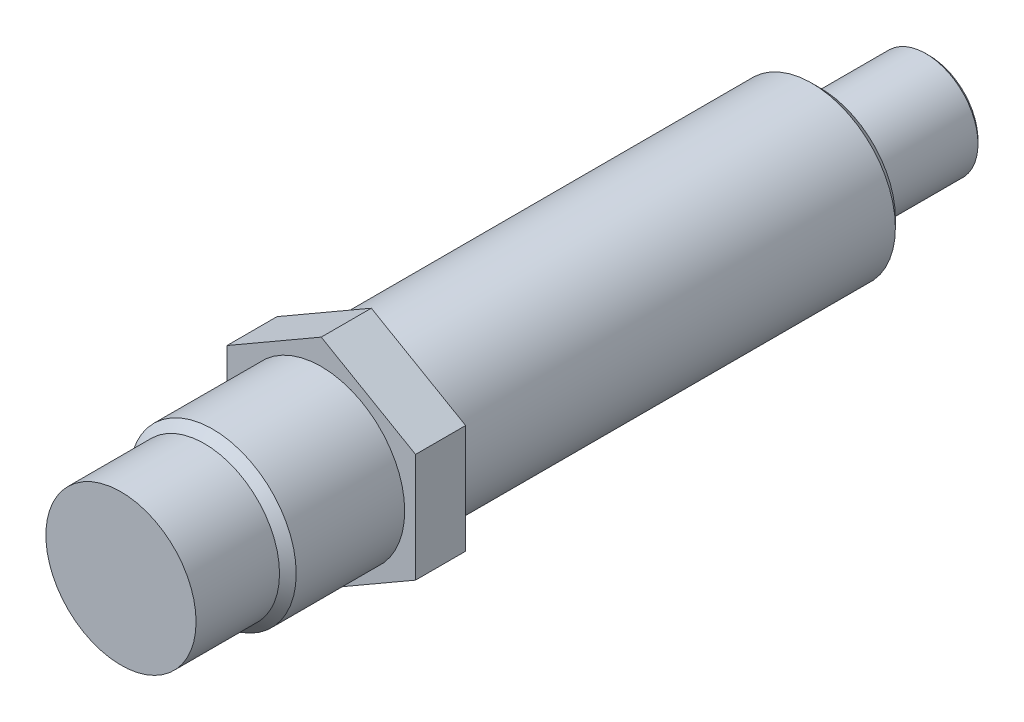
ISO-10303-21;
HEADER;
FILE_DESCRIPTION(('STEP AP214'),'2;1');
FILE_NAME('part.step','',(''),(''),'','','');
FILE_SCHEMA(('AUTOMOTIVE_DESIGN { 1 0 10303 214 1 1 1 1 }'));
ENDSEC;
DATA;
#1=APPLICATION_CONTEXT('core data for automotive mechanical design processes');
#2=APPLICATION_PROTOCOL_DEFINITION('international standard','automotive_design',2000,#1);
#3=PRODUCT_CONTEXT('',#1,'mechanical');
#4=PRODUCT('Part','Part','',(#3));
#5=PRODUCT_RELATED_PRODUCT_CATEGORY('part','',(#4));
#6=PRODUCT_DEFINITION_FORMATION('','',#4);
#7=PRODUCT_DEFINITION_CONTEXT('part definition',#1,'design');
#8=PRODUCT_DEFINITION('design','',#6,#7);
#9=PRODUCT_DEFINITION_SHAPE('','',#8);
#10=(LENGTH_UNIT() NAMED_UNIT(*) SI_UNIT(.MILLI.,.METRE.));
#11=(NAMED_UNIT(*) PLANE_ANGLE_UNIT() SI_UNIT($,.RADIAN.));
#12=(NAMED_UNIT(*) SI_UNIT($,.STERADIAN.) SOLID_ANGLE_UNIT());
#13=UNCERTAINTY_MEASURE_WITH_UNIT(LENGTH_MEASURE(1.E-05),#10,'distance_accuracy_value','');
#14=(GEOMETRIC_REPRESENTATION_CONTEXT(3) GLOBAL_UNCERTAINTY_ASSIGNED_CONTEXT((#13)) GLOBAL_UNIT_ASSIGNED_CONTEXT((#10,
#11,#12)) REPRESENTATION_CONTEXT('',''));
#15=CARTESIAN_POINT('',(0.,0.,0.));
#16=DIRECTION('',(0.,0.,1.));
#17=DIRECTION('',(1.,0.,0.));
#18=AXIS2_PLACEMENT_3D('',#15,#16,#17);
#19=CARTESIAN_POINT('',(0.,0.,-122.9995));
#20=DIRECTION('',(0.,0.,1.));
#21=DIRECTION('',(1.,0.,0.));
#22=AXIS2_PLACEMENT_3D('',#19,#20,#21);
#23=PLANE('',#22);
#24=CARTESIAN_POINT('',(0.,0.,-122.9995));
#25=DIRECTION('',(0.,0.,1.));
#26=DIRECTION('',(1.,0.,0.));
#27=AXIS2_PLACEMENT_3D('',#24,#25,#26);
#28=CIRCLE('',#27,7.4295);
#29=CARTESIAN_POINT('',(7.4295,0.,-122.9995));
#30=VERTEX_POINT('',#29);
#31=EDGE_CURVE('E48',#30,#30,#28,.T.);
#32=ORIENTED_EDGE('',*,*,#31,.F.);
#33=EDGE_LOOP('',(#32));
#34=FACE_BOUND('',#33,.T.);
#35=ADVANCED_FACE('F40',(#34),#23,.F.);
#36=CARTESIAN_POINT('',(0.,0.,-122.9995));
#37=DIRECTION('',(0.,0.,1.));
#38=DIRECTION('',(1.,0.,0.));
#39=AXIS2_PLACEMENT_3D('',#36,#37,#38);
#40=CONICAL_SURFACE('',#39,7.4295,0.785398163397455);
#41=CARTESIAN_POINT('',(0.,0.,-122.4915));
#42=DIRECTION('',(0.,0.,1.));
#43=DIRECTION('',(1.,0.,0.));
#44=AXIS2_PLACEMENT_3D('',#41,#42,#43);
#45=CIRCLE('',#44,7.9375);
#46=CARTESIAN_POINT('',(7.9375,0.,-122.4915));
#47=VERTEX_POINT('',#46);
#48=EDGE_CURVE('E170',#47,#47,#45,.T.);
#49=ORIENTED_EDGE('',*,*,#48,.F.);
#50=EDGE_LOOP('',(#49));
#51=FACE_BOUND('',#50,.T.);
#52=ORIENTED_EDGE('',*,*,#31,.T.);
#53=EDGE_LOOP('',(#52));
#54=FACE_BOUND('',#53,.T.);
#55=ADVANCED_FACE('F196',(#51,#54),#40,.T.);
#56=CARTESIAN_POINT('',(0.,0.,0.));
#57=DIRECTION('',(0.,0.,1.));
#58=DIRECTION('',(1.,0.,0.));
#59=AXIS2_PLACEMENT_3D('',#56,#57,#58);
#60=CYLINDRICAL_SURFACE('',#59,7.9375);
#61=CARTESIAN_POINT('',(0.,0.,-108.712));
#62=DIRECTION('',(0.,0.,1.));
#63=DIRECTION('',(1.,0.,0.));
#64=AXIS2_PLACEMENT_3D('',#61,#62,#63);
#65=CIRCLE('',#64,7.93749999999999);
#66=CARTESIAN_POINT('',(7.93749999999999,0.,-108.712));
#67=VERTEX_POINT('',#66);
#68=EDGE_CURVE('E167',#67,#67,#65,.T.);
#69=ORIENTED_EDGE('',*,*,#68,.F.);
#70=EDGE_LOOP('',(#69));
#71=FACE_BOUND('',#70,.T.);
#72=ORIENTED_EDGE('',*,*,#48,.T.);
#73=EDGE_LOOP('',(#72));
#74=FACE_BOUND('',#73,.T.);
#75=ADVANCED_FACE('F201',(#71,#74),#60,.T.);
#76=CARTESIAN_POINT('',(0.,7.93749999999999,-108.712));
#77=DIRECTION('',(0.,0.,-1.));
#78=DIRECTION('',(-1.,0.,0.));
#79=AXIS2_PLACEMENT_3D('',#76,#77,#78);
#80=PLANE('',#79);
#81=CARTESIAN_POINT('',(0.,0.,-108.712));
#82=DIRECTION('',(0.,0.,1.));
#83=DIRECTION('',(1.,0.,0.));
#84=AXIS2_PLACEMENT_3D('',#81,#82,#83);
#85=CIRCLE('',#84,3.175);
#86=CARTESIAN_POINT('',(3.175,0.,-108.712));
#87=VERTEX_POINT('',#86);
#88=EDGE_CURVE('E164',#87,#87,#85,.T.);
#89=ORIENTED_EDGE('',*,*,#88,.F.);
#90=EDGE_LOOP('',(#89));
#91=FACE_BOUND('',#90,.T.);
#92=ORIENTED_EDGE('',*,*,#68,.T.);
#93=EDGE_LOOP('',(#92));
#94=FACE_BOUND('',#93,.T.);
#95=ADVANCED_FACE('F208',(#91,#94),#80,.F.);
#96=CARTESIAN_POINT('',(0.,0.,0.));
#97=DIRECTION('',(0.,0.,1.));
#98=DIRECTION('',(1.,0.,0.));
#99=AXIS2_PLACEMENT_3D('',#96,#97,#98);
#100=CYLINDRICAL_SURFACE('',#99,3.175);
#101=CARTESIAN_POINT('',(0.,0.,-106.426));
#102=DIRECTION('',(0.,0.,1.));
#103=DIRECTION('',(1.,0.,0.));
#104=AXIS2_PLACEMENT_3D('',#101,#102,#103);
#105=CIRCLE('',#104,3.175);
#106=CARTESIAN_POINT('',(3.175,0.,-106.426));
#107=VERTEX_POINT('',#106);
#108=EDGE_CURVE('E161',#107,#107,#105,.T.);
#109=ORIENTED_EDGE('',*,*,#108,.F.);
#110=EDGE_LOOP('',(#109));
#111=FACE_BOUND('',#110,.T.);
#112=ORIENTED_EDGE('',*,*,#88,.T.);
#113=EDGE_LOOP('',(#112));
#114=FACE_BOUND('',#113,.T.);
#115=ADVANCED_FACE('F215',(#111,#114),#100,.T.);
#116=CARTESIAN_POINT('',(0.,3.175,-106.426));
#117=DIRECTION('',(0.,0.,1.));
#118=DIRECTION('',(1.,0.,0.));
#119=AXIS2_PLACEMENT_3D('',#116,#117,#118);
#120=PLANE('',#119);
#121=CARTESIAN_POINT('',(0.,0.,-106.426));
#122=DIRECTION('',(0.,0.,1.));
#123=DIRECTION('',(1.,0.,0.));
#124=AXIS2_PLACEMENT_3D('',#121,#122,#123);
#125=CIRCLE('',#124,11.43);
#126=CARTESIAN_POINT('',(11.43,0.,-106.426));
#127=VERTEX_POINT('',#126);
#128=EDGE_CURVE('E158',#127,#127,#125,.T.);
#129=ORIENTED_EDGE('',*,*,#128,.F.);
#130=EDGE_LOOP('',(#129));
#131=FACE_BOUND('',#130,.T.);
#132=ORIENTED_EDGE('',*,*,#108,.T.);
#133=EDGE_LOOP('',(#132));
#134=FACE_BOUND('',#133,.T.);
#135=ADVANCED_FACE('F219',(#131,#134),#120,.F.);
#136=CARTESIAN_POINT('',(0.,0.,-106.426));
#137=DIRECTION('',(0.,0.,1.));
#138=DIRECTION('',(1.,0.,0.));
#139=AXIS2_PLACEMENT_3D('',#136,#137,#138);
#140=CONICAL_SURFACE('',#139,11.43,0.785398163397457);
#141=CARTESIAN_POINT('',(0.,0.,-105.156));
#142=DIRECTION('',(0.,0.,1.));
#143=DIRECTION('',(1.,0.,0.));
#144=AXIS2_PLACEMENT_3D('',#141,#142,#143);
#145=CIRCLE('',#144,12.7);
#146=CARTESIAN_POINT('',(12.7,0.,-105.156));
#147=VERTEX_POINT('',#146);
#148=EDGE_CURVE('E155',#147,#147,#145,.T.);
#149=ORIENTED_EDGE('',*,*,#148,.F.);
#150=EDGE_LOOP('',(#149));
#151=FACE_BOUND('',#150,.T.);
#152=ORIENTED_EDGE('',*,*,#128,.T.);
#153=EDGE_LOOP('',(#152));
#154=FACE_BOUND('',#153,.T.);
#155=ADVANCED_FACE('F223',(#151,#154),#140,.T.);
#156=CARTESIAN_POINT('',(0.,0.,0.));
#157=DIRECTION('',(0.,0.,1.));
#158=DIRECTION('',(1.,0.,0.));
#159=AXIS2_PLACEMENT_3D('',#156,#157,#158);
#160=CYLINDRICAL_SURFACE('',#159,12.7);
#161=CARTESIAN_POINT('',(0.,0.,-38.1));
#162=DIRECTION('',(0.,0.,-1.));
#163=DIRECTION('',(-1.,0.,0.));
#164=AXIS2_PLACEMENT_3D('',#161,#162,#163);
#165=CIRCLE('',#164,12.7);
#166=CARTESIAN_POINT('',(-12.7,0.,-38.1));
#167=VERTEX_POINT('',#166);
#168=EDGE_CURVE('E145',#167,#167,#165,.T.);
#169=ORIENTED_EDGE('',*,*,#168,.T.);
#170=EDGE_LOOP('',(#169));
#171=FACE_BOUND('',#170,.T.);
#172=ORIENTED_EDGE('',*,*,#148,.T.);
#173=EDGE_LOOP('',(#172));
#174=FACE_BOUND('',#173,.T.);
#175=ADVANCED_FACE('F177',(#171,#174),#160,.T.);
#176=CARTESIAN_POINT('',(0.,-16.5711074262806,-30.48));
#177=DIRECTION('',(0.,0.,-1.));
#178=DIRECTION('',(-1.,0.,0.));
#179=AXIS2_PLACEMENT_3D('',#176,#177,#178);
#180=PLANE('',#179);
#181=DIRECTION('',(0.866025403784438,0.5,0.));
#182=VECTOR('',#181,1.);
#183=CARTESIAN_POINT('',(0.,-16.5711074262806,-30.48));
#184=LINE('',#183,#182);
#185=CARTESIAN_POINT('',(0.,-16.5711074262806,-30.48));
#186=VERTEX_POINT('',#185);
#187=CARTESIAN_POINT('',(14.351,-8.28555371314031,-30.48));
#188=VERTEX_POINT('',#187);
#189=EDGE_CURVE('E136',#186,#188,#184,.T.);
#190=ORIENTED_EDGE('',*,*,#189,.T.);
#191=DIRECTION('',(0.,1.,0.));
#192=VECTOR('',#191,1.);
#193=CARTESIAN_POINT('',(14.351,-8.28555371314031,-30.48));
#194=LINE('',#193,#192);
#195=CARTESIAN_POINT('',(14.351,8.28555371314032,-30.48));
#196=VERTEX_POINT('',#195);
#197=EDGE_CURVE('E94',#188,#196,#194,.T.);
#198=ORIENTED_EDGE('',*,*,#197,.T.);
#199=DIRECTION('',(-0.866025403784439,0.5,0.));
#200=VECTOR('',#199,1.);
#201=CARTESIAN_POINT('',(14.351,8.28555371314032,-30.48));
#202=LINE('',#201,#200);
#203=CARTESIAN_POINT('',(0.,16.5711074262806,-30.48));
#204=VERTEX_POINT('',#203);
#205=EDGE_CURVE('E108',#196,#204,#202,.T.);
#206=ORIENTED_EDGE('',*,*,#205,.T.);
#207=DIRECTION('',(-0.866025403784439,-0.5,0.));
#208=VECTOR('',#207,1.);
#209=CARTESIAN_POINT('',(0.,16.5711074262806,-30.48));
#210=LINE('',#209,#208);
#211=CARTESIAN_POINT('',(-14.351,8.28555371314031,-30.48));
#212=VERTEX_POINT('',#211);
#213=EDGE_CURVE('E101',#204,#212,#210,.T.);
#214=ORIENTED_EDGE('',*,*,#213,.T.);
#215=DIRECTION('',(0.,-1.,0.));
#216=VECTOR('',#215,1.);
#217=CARTESIAN_POINT('',(-14.351,8.28555371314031,-30.48));
#218=LINE('',#217,#216);
#219=CARTESIAN_POINT('',(-14.351,-8.28555371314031,-30.48));
#220=VERTEX_POINT('',#219);
#221=EDGE_CURVE('E106',#212,#220,#218,.T.);
#222=ORIENTED_EDGE('',*,*,#221,.T.);
#223=DIRECTION('',(0.866025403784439,-0.5,0.));
#224=VECTOR('',#223,1.);
#225=CARTESIAN_POINT('',(-14.351,-8.28555371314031,-30.48));
#226=LINE('',#225,#224);
#227=EDGE_CURVE('E56',#220,#186,#226,.T.);
#228=ORIENTED_EDGE('',*,*,#227,.T.);
#229=EDGE_LOOP('',(#190,#198,#206,#214,#222,#228));
#230=FACE_BOUND('',#229,.T.);
#231=CARTESIAN_POINT('',(0.,0.,-30.48));
#232=DIRECTION('',(0.,0.,-1.));
#233=DIRECTION('',(-1.,0.,0.));
#234=AXIS2_PLACEMENT_3D('',#231,#232,#233);
#235=CIRCLE('',#234,12.7);
#236=CARTESIAN_POINT('',(-12.7,0.,-30.48));
#237=VERTEX_POINT('',#236);
#238=EDGE_CURVE('E11',#237,#237,#235,.T.);
#239=ORIENTED_EDGE('',*,*,#238,.T.);
#240=EDGE_LOOP('',(#239));
#241=FACE_BOUND('',#240,.T.);
#242=ADVANCED_FACE('F103',(#230,#241),#180,.F.);
#243=CARTESIAN_POINT('',(0.,-16.5711074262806,-38.1));
#244=DIRECTION('',(0.,0.,-1.));
#245=DIRECTION('',(-1.,0.,0.));
#246=AXIS2_PLACEMENT_3D('',#243,#244,#245);
#247=PLANE('',#246);
#248=DIRECTION('',(0.866025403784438,0.5,0.));
#249=VECTOR('',#248,1.);
#250=CARTESIAN_POINT('',(0.,-16.5711074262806,-38.1));
#251=LINE('',#250,#249);
#252=CARTESIAN_POINT('',(0.,-16.5711074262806,-38.1));
#253=VERTEX_POINT('',#252);
#254=CARTESIAN_POINT('',(14.351,-8.28555371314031,-38.1));
#255=VERTEX_POINT('',#254);
#256=EDGE_CURVE('E126',#253,#255,#251,.T.);
#257=ORIENTED_EDGE('',*,*,#256,.F.);
#258=DIRECTION('',(0.866025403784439,-0.5,0.));
#259=VECTOR('',#258,1.);
#260=CARTESIAN_POINT('',(-14.351,-8.28555371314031,-38.1));
#261=LINE('',#260,#259);
#262=CARTESIAN_POINT('',(-14.351,-8.28555371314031,-38.1));
#263=VERTEX_POINT('',#262);
#264=EDGE_CURVE('E85',#263,#253,#261,.T.);
#265=ORIENTED_EDGE('',*,*,#264,.F.);
#266=DIRECTION('',(0.,-1.,0.));
#267=VECTOR('',#266,1.);
#268=CARTESIAN_POINT('',(-14.351,8.28555371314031,-38.1));
#269=LINE('',#268,#267);
#270=CARTESIAN_POINT('',(-14.351,8.28555371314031,-38.1));
#271=VERTEX_POINT('',#270);
#272=EDGE_CURVE('E79',#271,#263,#269,.T.);
#273=ORIENTED_EDGE('',*,*,#272,.F.);
#274=DIRECTION('',(-0.866025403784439,-0.5,0.));
#275=VECTOR('',#274,1.);
#276=CARTESIAN_POINT('',(0.,16.5711074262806,-38.1));
#277=LINE('',#276,#275);
#278=CARTESIAN_POINT('',(0.,16.5711074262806,-38.1));
#279=VERTEX_POINT('',#278);
#280=EDGE_CURVE('E116',#279,#271,#277,.T.);
#281=ORIENTED_EDGE('',*,*,#280,.F.);
#282=DIRECTION('',(-0.866025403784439,0.5,0.));
#283=VECTOR('',#282,1.);
#284=CARTESIAN_POINT('',(14.351,8.28555371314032,-38.1));
#285=LINE('',#284,#283);
#286=CARTESIAN_POINT('',(14.351,8.28555371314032,-38.1));
#287=VERTEX_POINT('',#286);
#288=EDGE_CURVE('E131',#287,#279,#285,.T.);
#289=ORIENTED_EDGE('',*,*,#288,.F.);
#290=DIRECTION('',(0.,1.,0.));
#291=VECTOR('',#290,1.);
#292=CARTESIAN_POINT('',(14.351,-8.28555371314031,-38.1));
#293=LINE('',#292,#291);
#294=EDGE_CURVE('E129',#255,#287,#293,.T.);
#295=ORIENTED_EDGE('',*,*,#294,.F.);
#296=EDGE_LOOP('',(#257,#265,#273,#281,#289,#295));
#297=FACE_BOUND('',#296,.T.);
#298=ORIENTED_EDGE('',*,*,#168,.F.);
#299=EDGE_LOOP('',(#298));
#300=FACE_BOUND('',#299,.T.);
#301=ADVANCED_FACE('F180',(#297,#300),#247,.T.);
#302=CARTESIAN_POINT('',(0.,-16.5711074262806,-30.48));
#303=DIRECTION('',(-0.5,0.866025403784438,0.));
#304=DIRECTION('',(-0.866025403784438,-0.5,0.));
#305=AXIS2_PLACEMENT_3D('',#302,#303,#304);
#306=PLANE('',#305);
#307=ORIENTED_EDGE('',*,*,#256,.T.);
#308=DIRECTION('',(0.,0.,-1.));
#309=VECTOR('',#308,1.);
#310=CARTESIAN_POINT('',(14.351,-8.28555371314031,-30.48));
#311=LINE('',#310,#309);
#312=EDGE_CURVE('E143',#188,#255,#311,.T.);
#313=ORIENTED_EDGE('',*,*,#312,.F.);
#314=ORIENTED_EDGE('',*,*,#189,.F.);
#315=DIRECTION('',(0.,0.,-1.));
#316=VECTOR('',#315,1.);
#317=CARTESIAN_POINT('',(0.,-16.5711074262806,-30.48));
#318=LINE('',#317,#316);
#319=EDGE_CURVE('E122',#186,#253,#318,.T.);
#320=ORIENTED_EDGE('',*,*,#319,.T.);
#321=EDGE_LOOP('',(#307,#313,#314,#320));
#322=FACE_BOUND('',#321,.T.);
#323=ADVANCED_FACE('F182',(#322),#306,.F.);
#324=CARTESIAN_POINT('',(14.351,-8.28555371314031,-30.48));
#325=DIRECTION('',(-1.,0.,0.));
#326=DIRECTION('',(0.,0.,1.));
#327=AXIS2_PLACEMENT_3D('',#324,#325,#326);
#328=PLANE('',#327);
#329=ORIENTED_EDGE('',*,*,#294,.T.);
#330=DIRECTION('',(0.,0.,-1.));
#331=VECTOR('',#330,1.);
#332=CARTESIAN_POINT('',(14.351,8.28555371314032,-30.48));
#333=LINE('',#332,#331);
#334=EDGE_CURVE('E140',#196,#287,#333,.T.);
#335=ORIENTED_EDGE('',*,*,#334,.F.);
#336=ORIENTED_EDGE('',*,*,#197,.F.);
#337=ORIENTED_EDGE('',*,*,#312,.T.);
#338=EDGE_LOOP('',(#329,#335,#336,#337));
#339=FACE_BOUND('',#338,.T.);
#340=ADVANCED_FACE('F189',(#339),#328,.F.);
#341=CARTESIAN_POINT('',(14.351,8.28555371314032,-30.48));
#342=DIRECTION('',(-0.5,-0.866025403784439,0.));
#343=DIRECTION('',(0.866025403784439,-0.5,0.));
#344=AXIS2_PLACEMENT_3D('',#341,#342,#343);
#345=PLANE('',#344);
#346=ORIENTED_EDGE('',*,*,#288,.T.);
#347=DIRECTION('',(0.,0.,-1.));
#348=VECTOR('',#347,1.);
#349=CARTESIAN_POINT('',(0.,16.5711074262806,-30.48));
#350=LINE('',#349,#348);
#351=EDGE_CURVE('E117',#204,#279,#350,.T.);
#352=ORIENTED_EDGE('',*,*,#351,.F.);
#353=ORIENTED_EDGE('',*,*,#205,.F.);
#354=ORIENTED_EDGE('',*,*,#334,.T.);
#355=EDGE_LOOP('',(#346,#352,#353,#354));
#356=FACE_BOUND('',#355,.T.);
#357=ADVANCED_FACE('F246',(#356),#345,.F.);
#358=CARTESIAN_POINT('',(0.,16.5711074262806,-30.48));
#359=DIRECTION('',(0.5,-0.866025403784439,0.));
#360=DIRECTION('',(0.866025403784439,0.5,0.));
#361=AXIS2_PLACEMENT_3D('',#358,#359,#360);
#362=PLANE('',#361);
#363=ORIENTED_EDGE('',*,*,#280,.T.);
#364=DIRECTION('',(0.,0.,-1.));
#365=VECTOR('',#364,1.);
#366=CARTESIAN_POINT('',(-14.351,8.28555371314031,-30.48));
#367=LINE('',#366,#365);
#368=EDGE_CURVE('E113',#212,#271,#367,.T.);
#369=ORIENTED_EDGE('',*,*,#368,.F.);
#370=ORIENTED_EDGE('',*,*,#213,.F.);
#371=ORIENTED_EDGE('',*,*,#351,.T.);
#372=EDGE_LOOP('',(#363,#369,#370,#371));
#373=FACE_BOUND('',#372,.T.);
#374=ADVANCED_FACE('F114',(#373),#362,.F.);
#375=CARTESIAN_POINT('',(-14.351,8.28555371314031,-30.48));
#376=DIRECTION('',(1.,0.,0.));
#377=DIRECTION('',(0.,1.,0.));
#378=AXIS2_PLACEMENT_3D('',#375,#376,#377);
#379=PLANE('',#378);
#380=ORIENTED_EDGE('',*,*,#272,.T.);
#381=DIRECTION('',(0.,0.,-1.));
#382=VECTOR('',#381,1.);
#383=CARTESIAN_POINT('',(-14.351,-8.28555371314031,-30.48));
#384=LINE('',#383,#382);
#385=EDGE_CURVE('E118',#220,#263,#384,.T.);
#386=ORIENTED_EDGE('',*,*,#385,.F.);
#387=ORIENTED_EDGE('',*,*,#221,.F.);
#388=ORIENTED_EDGE('',*,*,#368,.T.);
#389=EDGE_LOOP('',(#380,#386,#387,#388));
#390=FACE_BOUND('',#389,.T.);
#391=ADVANCED_FACE('F120',(#390),#379,.F.);
#392=CARTESIAN_POINT('',(-14.351,-8.28555371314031,-30.48));
#393=DIRECTION('',(0.5,0.866025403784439,0.));
#394=DIRECTION('',(-0.866025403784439,0.5,0.));
#395=AXIS2_PLACEMENT_3D('',#392,#393,#394);
#396=PLANE('',#395);
#397=ORIENTED_EDGE('',*,*,#264,.T.);
#398=ORIENTED_EDGE('',*,*,#319,.F.);
#399=ORIENTED_EDGE('',*,*,#227,.F.);
#400=ORIENTED_EDGE('',*,*,#385,.T.);
#401=EDGE_LOOP('',(#397,#398,#399,#400));
#402=FACE_BOUND('',#401,.T.);
#403=ADVANCED_FACE('F241',(#402),#396,.F.);
#404=CARTESIAN_POINT('',(0.,11.43,0.));
#405=DIRECTION('',(0.,0.,-1.));
#406=DIRECTION('',(-1.,0.,0.));
#407=AXIS2_PLACEMENT_3D('',#404,#405,#406);
#408=PLANE('',#407);
#409=CARTESIAN_POINT('',(0.,0.,0.));
#410=DIRECTION('',(0.,0.,1.));
#411=DIRECTION('',(1.,0.,0.));
#412=AXIS2_PLACEMENT_3D('',#409,#410,#411);
#413=CIRCLE('',#412,11.43);
#414=CARTESIAN_POINT('',(11.43,0.,0.));
#415=VERTEX_POINT('',#414);
#416=EDGE_CURVE('E146',#415,#415,#413,.T.);
#417=ORIENTED_EDGE('',*,*,#416,.T.);
#418=EDGE_LOOP('',(#417));
#419=FACE_BOUND('',#418,.T.);
#420=ADVANCED_FACE('F238',(#419),#408,.F.);
#421=CARTESIAN_POINT('',(0.,0.,0.));
#422=DIRECTION('',(0.,0.,1.));
#423=DIRECTION('',(1.,0.,0.));
#424=AXIS2_PLACEMENT_3D('',#421,#422,#423);
#425=CYLINDRICAL_SURFACE('',#424,11.43);
#426=ORIENTED_EDGE('',*,*,#416,.F.);
#427=EDGE_LOOP('',(#426));
#428=FACE_BOUND('',#427,.T.);
#429=CARTESIAN_POINT('',(0.,0.,-12.7));
#430=DIRECTION('',(0.,0.,1.));
#431=DIRECTION('',(1.,0.,0.));
#432=AXIS2_PLACEMENT_3D('',#429,#430,#431);
#433=CIRCLE('',#432,11.43);
#434=CARTESIAN_POINT('',(11.43,0.,-12.7));
#435=VERTEX_POINT('',#434);
#436=EDGE_CURVE('E149',#435,#435,#433,.T.);
#437=ORIENTED_EDGE('',*,*,#436,.T.);
#438=EDGE_LOOP('',(#437));
#439=FACE_BOUND('',#438,.T.);
#440=ADVANCED_FACE('F234',(#428,#439),#425,.T.);
#441=CARTESIAN_POINT('',(0.,0.,-13.97));
#442=DIRECTION('',(0.,0.,-1.));
#443=DIRECTION('',(-1.,0.,0.));
#444=AXIS2_PLACEMENT_3D('',#441,#442,#443);
#445=CONICAL_SURFACE('',#444,12.7,0.785398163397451);
#446=ORIENTED_EDGE('',*,*,#436,.F.);
#447=EDGE_LOOP('',(#446));
#448=FACE_BOUND('',#447,.T.);
#449=CARTESIAN_POINT('',(0.,0.,-13.97));
#450=DIRECTION('',(0.,0.,1.));
#451=DIRECTION('',(1.,0.,0.));
#452=AXIS2_PLACEMENT_3D('',#449,#450,#451);
#453=CIRCLE('',#452,12.7);
#454=CARTESIAN_POINT('',(12.7,0.,-13.97));
#455=VERTEX_POINT('',#454);
#456=EDGE_CURVE('E152',#455,#455,#453,.T.);
#457=ORIENTED_EDGE('',*,*,#456,.T.);
#458=EDGE_LOOP('',(#457));
#459=FACE_BOUND('',#458,.T.);
#460=ADVANCED_FACE('F231',(#448,#459),#445,.T.);
#461=ORIENTED_EDGE('',*,*,#456,.F.);
#462=EDGE_LOOP('',(#461));
#463=FACE_BOUND('',#462,.T.);
#464=ORIENTED_EDGE('',*,*,#238,.F.);
#465=EDGE_LOOP('',(#464));
#466=FACE_BOUND('',#465,.T.);
#467=ADVANCED_FACE('F230',(#463,#466),#160,.T.);
#468=CLOSED_SHELL('',(#35,#55,#75,#95,#115,#135,#155,#175,#242,#301,#323,#340,#357,#374,#391,
#403,#420,#440,#460,#467));
#469=MANIFOLD_SOLID_BREP('B2',#468);
#470=ADVANCED_BREP_SHAPE_REPRESENTATION('',(#18,#469),#14);
#471=SHAPE_DEFINITION_REPRESENTATION(#9,#470);
ENDSEC;
END-ISO-10303-21;
